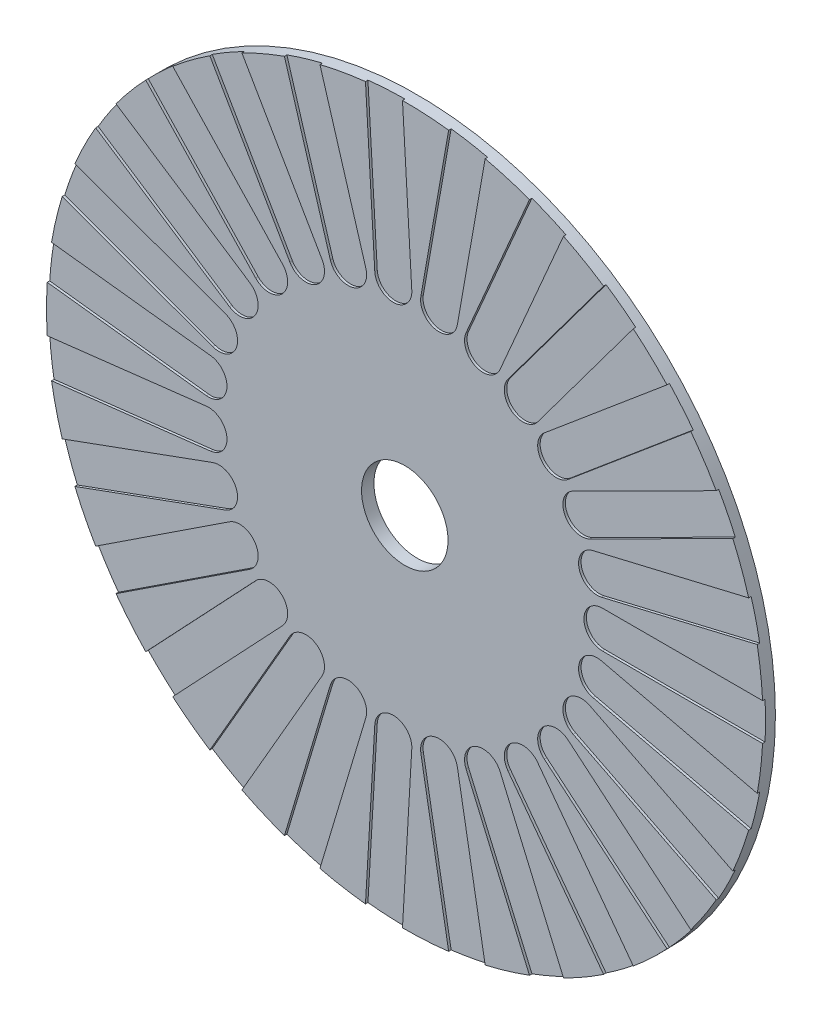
from build123d import *

# Parameters (mm, degrees)
ESQUISSE1_R             = 29
BOSS_EXTRU_1_DEPTH      = 1
ENL_V_MAT_EXTRU_1_DEPTH = 0.2
ESQUISSE3_R             = 3.5
ENL_V_MAT_EXTRU_2_DEPTH = 42.024382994


with BuildPart() as part:
    # Esquisse1 → Boss.-Extru.1 (new body)
    with BuildSketch(Plane.XY):
        Circle(ESQUISSE1_R)
    extrude(amount=BOSS_EXTRU_1_DEPTH)

    # Esquisse2 → Enl_v. mat.-Extru.1 (cut)
    with BuildSketch(Plane.XY.offset(1)):
        with BuildLine():
            Line((16, 1.5), (29, 1.5))
            ThreePointArc((29, 1.5), (30.5, 0), (29, -1.5))
            Line((29, -1.5), (16, -1.5))
            ThreePointArc((16, -1.5), (14.5, 0), (16, 1.5))
        make_face()
        with BuildLine():
            Line((15.914641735, -2.230286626), (28.564225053, -5.228292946))
            ThreePointArc((28.564225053, -5.228292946), (29.677868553, -7.033784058), (27.872377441, -8.147427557))
            Line((27.872377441, -8.147427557), (15.222794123, -5.149421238))
            ThreePointArc((15.222794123, -5.149421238), (14.109150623, -3.343930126), (15.914641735, -2.230286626))
        make_face()
        with BuildLine():
            Line((14.971321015, -5.840337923), (26.58854534, -11.674727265))
            ThreePointArc((26.58854534, -11.674727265), (27.25579553, -13.688374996), (25.242147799, -14.355625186))
            Line((25.242147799, -14.355625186), (13.624923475, -8.521235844))
            ThreePointArc((13.624923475, -8.521235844), (12.957673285, -6.507588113), (14.971321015, -5.840337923))
        make_face()
        with BuildLine():
            Line((13.220892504, -9.13553509), (23.179470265, -17.491774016))
            ThreePointArc((23.179470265, -17.491774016), (23.364355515, -19.605022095), (21.251107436, -19.789907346))
            Line((21.251107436, -19.789907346), (11.292529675, -11.43366842))
            ThreePointArc((11.292529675, -11.43366842), (11.107644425, -9.32042034), (13.220892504, -9.13553509))
        make_face()
        with BuildLine():
            Line((10.757722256, -11.938233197), (18.520783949, -22.365834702))
            ThreePointArc((18.520783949, -22.365834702), (18.213337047, -24.464757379), (16.11441437, -24.157310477))
            Line((16.11441437, -24.157310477), (8.351352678, -13.729708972))
            ThreePointArc((8.351352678, -13.729708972), (8.65879958, -11.630786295), (10.757722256, -11.938233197))
        make_face()
        with BuildLine():
            Line((7.714600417, -14.097338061), (12.863637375, -26.03414745))
            ThreePointArc((12.863637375, -26.03414745), (12.080432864, -28.00559126), (10.108989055, -27.222386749))
            Line((10.108989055, -27.222386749), (4.959952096, -15.285577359))
            ThreePointArc((4.959952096, -15.285577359), (5.743156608, -13.31413355), (7.714600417, -14.097338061))
        make_face()
        with BuildLine():
            Line((4.255582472, -15.496451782), (6.513008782, -28.298952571))
            ThreePointArc((6.513008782, -28.298952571), (5.296269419, -30.036636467), (3.558585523, -28.819897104))
            Line((3.558585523, -28.819897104), (1.301159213, -16.017396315))
            ThreePointArc((1.301159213, -16.017396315), (2.517898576, -14.279712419), (4.255582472, -15.496451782))
        make_face()
        with BuildLine():
            Line((0.567144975, -16.060147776), (-0.188737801, -29.038153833))
            ThreePointArc((-0.188737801, -29.038153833), (-1.773417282, -30.448398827), (-3.183662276, -28.863719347))
            Line((-3.183662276, -28.863719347), (-2.4277795, -15.885713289))
            ThreePointArc((-2.4277795, -15.885713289), (-0.843100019, -14.475468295), (0.567144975, -16.060147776))
        make_face()
        with BuildLine():
            Line((-3.151867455, -15.758037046), (-6.88030948, -28.211900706))
            ThreePointArc((-6.88030948, -28.211900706), (-8.747498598, -29.218680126), (-9.754278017, -27.351491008))
            Line((-9.754278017, -27.351491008), (-6.025835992, -14.897627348))
            ThreePointArc((-6.025835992, -14.897627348), (-4.158646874, -13.890847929), (-3.151867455, -15.758037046))
        make_face()
        with BuildLine():
            Line((-6.700961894, -14.606406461), (-13.200961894, -25.86473671))
            ThreePointArc((-13.200961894, -25.86473671), (-15.25, -26.413774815), (-15.799038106, -24.36473671))
            Line((-15.799038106, -24.36473671), (-9.299038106, -13.106406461))
            ThreePointArc((-9.299038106, -13.106406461), (-7.25, -12.557368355), (-6.700961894, -14.606406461))
        make_face()
        with BuildLine():
            Line((-9.888805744, -12.667340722), (-18.809947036, -22.123198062))
            ThreePointArc((-18.809947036, -22.123198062), (-20.930369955, -22.184896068), (-20.992067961, -20.064473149))
            Line((-20.992067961, -20.064473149), (-12.070926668, -10.608615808))
            ThreePointArc((-12.070926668, -10.608615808), (-9.950503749, -10.546917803), (-9.888805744, -12.667340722))
        make_face()
        with BuildLine():
            Line((-12.543541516, -10.045375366), (-23.404883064, -17.188992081))
            ThreePointArc((-23.404883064, -17.188992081), (-25.482378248, -16.760023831), (-25.053409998, -14.682528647))
            Line((-25.053409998, -14.682528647), (-14.19206845, -7.538911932))
            ThreePointArc((-14.19206845, -7.538911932), (-12.114573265, -7.967880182), (-12.543541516, -10.045375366))
        make_face()
        with BuildLine():
            Line((-14.522051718, -6.881861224), (-26.738055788, -11.328123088))
            ThreePointArc((-26.738055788, -11.328123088), (-28.660624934, -10.431614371), (-27.764116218, -8.509045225))
            Line((-27.764116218, -8.509045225), (-15.548112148, -4.062783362))
            ThreePointArc((-15.548112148, -4.062783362), (-13.625543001, -4.959292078), (-14.522051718, -6.881861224))
        make_face()
        with BuildLine():
            Line((-15.717674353, -3.347344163), (-28.629773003, -4.856552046))
            ThreePointArc((-28.629773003, -4.856552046), (-30.293769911, -3.540833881), (-28.978051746, -1.876836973))
            Line((-28.978051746, -1.876836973), (-16.065953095, -0.367629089))
            ThreePointArc((-16.065953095, -0.367629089), (-14.401956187, -1.683347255), (-15.717674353, -3.347344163))
        make_face()
        with BuildLine():
            Line((-16.065953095, 0.367629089), (-28.978051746, 1.876836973))
            ThreePointArc((-28.978051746, 1.876836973), (-30.293769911, 3.540833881), (-28.629773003, 4.856552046))
            Line((-28.629773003, 4.856552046), (-15.717674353, 3.347344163))
            ThreePointArc((-15.717674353, 3.347344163), (-14.401956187, 1.683347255), (-16.065953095, 0.367629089))
        make_face()
        with BuildLine():
            Line((-15.548112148, 4.062783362), (-27.764116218, 8.509045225))
            ThreePointArc((-27.764116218, 8.509045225), (-28.660624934, 10.431614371), (-26.738055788, 11.328123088))
            Line((-26.738055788, 11.328123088), (-14.522051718, 6.881861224))
            ThreePointArc((-14.522051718, 6.881861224), (-13.625543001, 4.959292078), (-15.548112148, 4.062783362))
        make_face()
        with BuildLine():
            Line((-14.19206845, 7.538911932), (-25.053409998, 14.682528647))
            ThreePointArc((-25.053409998, 14.682528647), (-25.482378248, 16.760023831), (-23.404883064, 17.188992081))
            Line((-23.404883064, 17.188992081), (-12.543541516, 10.045375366))
            ThreePointArc((-12.543541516, 10.045375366), (-12.114573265, 7.967880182), (-14.19206845, 7.538911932))
        make_face()
        with BuildLine():
            Line((-12.070926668, 10.608615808), (-20.992067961, 20.064473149))
            ThreePointArc((-20.992067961, 20.064473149), (-20.930369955, 22.184896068), (-18.809947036, 22.123198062))
            Line((-18.809947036, 22.123198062), (-9.888805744, 12.667340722))
            ThreePointArc((-9.888805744, 12.667340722), (-9.950503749, 10.546917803), (-12.070926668, 10.608615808))
        make_face()
        with BuildLine():
            Line((-9.299038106, 13.106406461), (-15.799038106, 24.36473671))
            ThreePointArc((-15.799038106, 24.36473671), (-15.25, 26.413774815), (-13.200961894, 25.86473671))
            Line((-13.200961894, 25.86473671), (-6.700961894, 14.606406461))
            ThreePointArc((-6.700961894, 14.606406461), (-7.25, 12.557368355), (-9.299038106, 13.106406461))
        make_face()
        with BuildLine():
            Line((-6.025835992, 14.897627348), (-9.754278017, 27.351491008))
            ThreePointArc((-9.754278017, 27.351491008), (-8.747498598, 29.218680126), (-6.88030948, 28.211900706))
            Line((-6.88030948, 28.211900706), (-3.151867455, 15.758037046))
            ThreePointArc((-3.151867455, 15.758037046), (-4.158646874, 13.890847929), (-6.025835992, 14.897627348))
        make_face()
        with BuildLine():
            Line((-2.4277795, 15.885713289), (-3.183662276, 28.863719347))
            ThreePointArc((-3.183662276, 28.863719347), (-1.773417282, 30.448398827), (-0.188737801, 29.038153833))
            Line((-0.188737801, 29.038153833), (0.567144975, 16.060147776))
            ThreePointArc((0.567144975, 16.060147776), (-0.843100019, 14.475468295), (-2.4277795, 15.885713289))
        make_face()
        with BuildLine():
            Line((1.301159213, 16.017396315), (3.558585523, 28.819897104))
            ThreePointArc((3.558585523, 28.819897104), (5.296269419, 30.036636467), (6.513008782, 28.298952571))
            Line((6.513008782, 28.298952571), (4.255582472, 15.496451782))
            ThreePointArc((4.255582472, 15.496451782), (2.517898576, 14.279712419), (1.301159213, 16.017396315))
        make_face()
        with BuildLine():
            Line((4.959952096, 15.285577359), (10.108989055, 27.222386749))
            ThreePointArc((10.108989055, 27.222386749), (12.080432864, 28.00559126), (12.863637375, 26.03414745))
            Line((12.863637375, 26.03414745), (7.714600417, 14.097338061))
            ThreePointArc((7.714600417, 14.097338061), (5.743156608, 13.31413355), (4.959952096, 15.285577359))
        make_face()
        with BuildLine():
            Line((8.351352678, 13.729708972), (16.11441437, 24.157310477))
            ThreePointArc((16.11441437, 24.157310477), (18.213337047, 24.464757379), (18.520783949, 22.365834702))
            Line((18.520783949, 22.365834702), (10.757722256, 11.938233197))
            ThreePointArc((10.757722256, 11.938233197), (8.65879958, 11.630786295), (8.351352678, 13.729708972))
        make_face()
        with BuildLine():
            Line((11.292529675, 11.43366842), (21.251107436, 19.789907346))
            ThreePointArc((21.251107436, 19.789907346), (23.364355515, 19.605022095), (23.179470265, 17.491774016))
            Line((23.179470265, 17.491774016), (13.220892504, 9.13553509))
            ThreePointArc((13.220892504, 9.13553509), (11.107644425, 9.32042034), (11.292529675, 11.43366842))
        make_face()
        with BuildLine():
            Line((13.624923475, 8.521235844), (25.242147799, 14.355625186))
            ThreePointArc((25.242147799, 14.355625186), (27.25579553, 13.688374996), (26.58854534, 11.674727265))
            Line((26.58854534, 11.674727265), (14.971321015, 5.840337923))
            ThreePointArc((14.971321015, 5.840337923), (12.957673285, 6.507588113), (13.624923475, 8.521235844))
        make_face()
        with BuildLine():
            Line((15.222794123, 5.149421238), (27.872377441, 8.147427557))
            ThreePointArc((27.872377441, 8.147427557), (29.677868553, 7.033784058), (28.564225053, 5.228292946))
            Line((28.564225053, 5.228292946), (15.914641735, 2.230286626))
            ThreePointArc((15.914641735, 2.230286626), (14.109150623, 3.343930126), (15.222794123, 5.149421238))
        make_face()
    extrude(amount=-ENL_V_MAT_EXTRU_1_DEPTH, mode=Mode.SUBTRACT)

    # Esquisse3 → Enl_v. mat.-Extru.2 (cut, through all)
    with BuildSketch(Plane.XY.offset(1)):
        Circle(ESQUISSE3_R)
    extrude(amount=-ENL_V_MAT_EXTRU_2_DEPTH, mode=Mode.SUBTRACT)


solid = part.part
